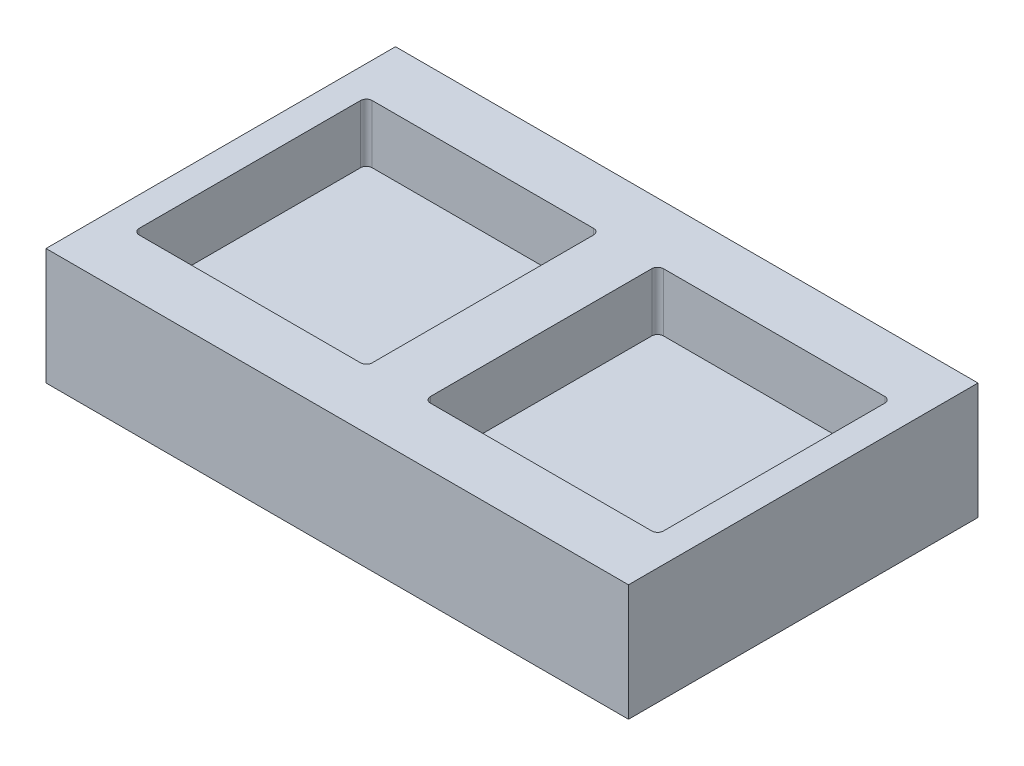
from build123d import *

# Parameters (mm, degrees)
SKETCH1_W          = 127
SKETCH1_H          = 76.2
EXTRUDE1_DEPTH     = 25.4
SKETCH2_W          = 50.8
SKETCH2_H          = 50.8
CUT_EXTRUDE1_DEPTH = 12.7
FILLET1_R          = 1.27


with BuildPart() as part:
    # Sketch1 → Extrude1 (new body)
    with BuildSketch(Plane(origin=(0, 0, 0), x_dir=(1, 0, 0), z_dir=(0, 1, 0))):
        Rectangle(SKETCH1_W, SKETCH1_H)
    extrude(amount=EXTRUDE1_DEPTH)

    # Sketch2 → Cut-Extrude1 (cut)
    with BuildSketch(Plane(origin=(0, 25.4, 0), x_dir=(-1, 0, 0), z_dir=(0, 1, 0))):
        with Locations((-31.75, 0)):
            Rectangle(SKETCH2_W, SKETCH2_H)
        with Locations((31.75, 0)):
            Rectangle(SKETCH2_W, SKETCH2_H)
    extrude(amount=-CUT_EXTRUDE1_DEPTH, mode=Mode.SUBTRACT)

    # Fillet1
    fillet1_edges = [part.edges().sort_by_distance(p)[0] for p in [
        (6.35, 19.05, -25.4),
        (57.15, 19.05, -25.4),
        (57.15, 19.05, 25.4),
        (6.35, 19.05, 25.4),
        (-57.15, 19.05, -25.4),
        (-6.35, 19.05, -25.4),
        (-6.35, 19.05, 25.4),
        (-57.15, 19.05, 25.4),
    ]]
    fillet(fillet1_edges, radius=FILLET1_R)


solid = part.part
